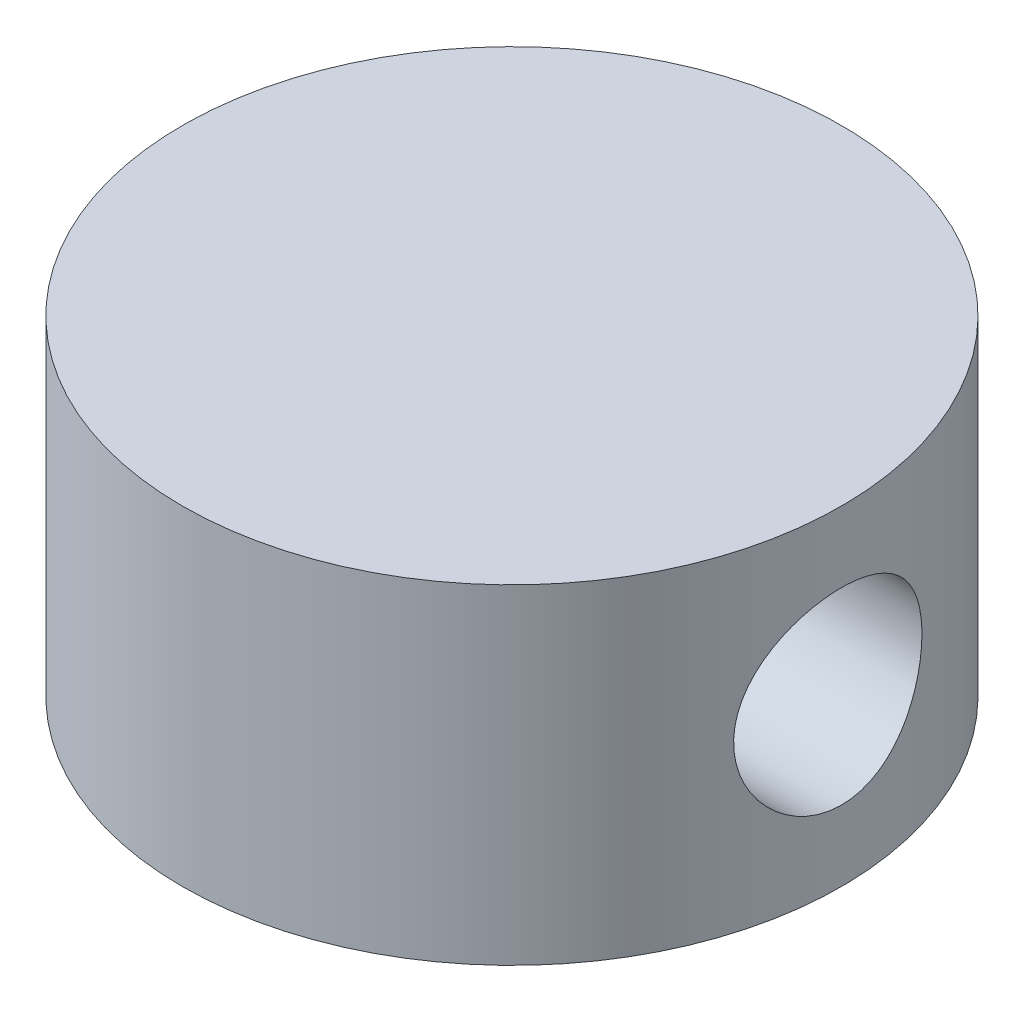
from build123d import *

# Parameters (mm, degrees)
SKETCH1_R           = 7
BOSS_EXTRUDE1_DEPTH = 7
CUT_EXTRUDE1_DEPTH  = 11


with BuildPart() as part:
    # Sketch1 → Boss-Extrude1 (new body)
    with BuildSketch(Plane(origin=(0, 0, 0), x_dir=(1, 0, 0), z_dir=(0, 1, 0))):
        with Locations(Location((0, 0, 0), (0, 0, 270))):
            Circle(SKETCH1_R)
    extrude(amount=BOSS_EXTRUDE1_DEPTH)

    # Sketch2 → Cut-Extrude1 (cut)
    with BuildSketch(Plane(origin=(7, 0, 0), x_dir=(0, 0, -1), z_dir=(1, 0, 0))):
        with BuildLine():
            ThreePointArc((2, 3.5), (1.414213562, 4.914213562), (0, 5.5))
            Line((0, 5.5), (0, 1.5))
            ThreePointArc((0, 1.5), (1.414213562, 2.085786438), (2, 3.5))
        make_face()
        with BuildLine():
            Line((0, 1.5), (0, 5.5))
            ThreePointArc((0, 5.5), (-2, 3.5), (0, 1.5))
        make_face()
        with BuildLine():
            ThreePointArc((2, 3.5), (1.414213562, 4.914213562), (0, 5.5))
            Line((0, 5.5), (0, 1.5))
            ThreePointArc((0, 1.5), (1.414213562, 2.085786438), (2, 3.5))
        make_face()
        with BuildLine():
            Line((0, 1.5), (0, 5.5))
            ThreePointArc((0, 5.5), (-2, 3.5), (0, 1.5))
        make_face()
    extrude(amount=-CUT_EXTRUDE1_DEPTH, mode=Mode.SUBTRACT)


solid = part.part
